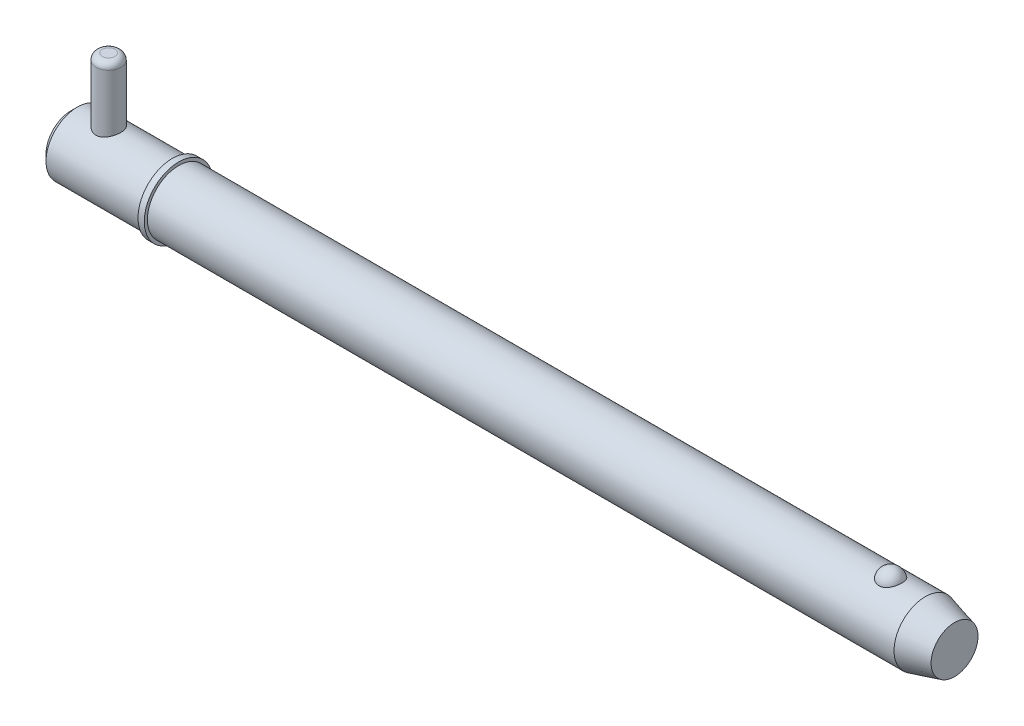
ISO-10303-21;
HEADER;
FILE_DESCRIPTION(('STEP AP214'),'2;1');
FILE_NAME('part.step','',(''),(''),'','','');
FILE_SCHEMA(('AUTOMOTIVE_DESIGN { 1 0 10303 214 1 1 1 1 }'));
ENDSEC;
DATA;
#1=APPLICATION_CONTEXT('core data for automotive mechanical design processes');
#2=APPLICATION_PROTOCOL_DEFINITION('international standard','automotive_design',2000,#1);
#3=PRODUCT_CONTEXT('',#1,'mechanical');
#4=PRODUCT('Part','Part','',(#3));
#5=PRODUCT_RELATED_PRODUCT_CATEGORY('part','',(#4));
#6=PRODUCT_DEFINITION_FORMATION('','',#4);
#7=PRODUCT_DEFINITION_CONTEXT('part definition',#1,'design');
#8=PRODUCT_DEFINITION('design','',#6,#7);
#9=PRODUCT_DEFINITION_SHAPE('','',#8);
#10=(LENGTH_UNIT() NAMED_UNIT(*) SI_UNIT(.MILLI.,.METRE.));
#11=(NAMED_UNIT(*) PLANE_ANGLE_UNIT() SI_UNIT($,.RADIAN.));
#12=(NAMED_UNIT(*) SI_UNIT($,.STERADIAN.) SOLID_ANGLE_UNIT());
#13=UNCERTAINTY_MEASURE_WITH_UNIT(LENGTH_MEASURE(1.E-05),#10,'distance_accuracy_value','');
#14=(GEOMETRIC_REPRESENTATION_CONTEXT(3) GLOBAL_UNCERTAINTY_ASSIGNED_CONTEXT((#13)) GLOBAL_UNIT_ASSIGNED_CONTEXT((#10,
#11,#12)) REPRESENTATION_CONTEXT('',''));
#15=CARTESIAN_POINT('',(0.,0.,0.));
#16=DIRECTION('',(0.,0.,1.));
#17=DIRECTION('',(1.,0.,0.));
#18=AXIS2_PLACEMENT_3D('',#15,#16,#17);
#19=CARTESIAN_POINT('',(9.525,23.81,0.));
#20=DIRECTION('',(0.,-1.,0.));
#21=DIRECTION('',(0.,0.,-1.));
#22=AXIS2_PLACEMENT_3D('',#19,#20,#21);
#23=CYLINDRICAL_SURFACE('',#22,3.175);
#24=CARTESIAN_POINT('',(9.525,-6.3525,0.));
#25=DIRECTION('',(0.,1.,0.));
#26=DIRECTION('',(0.,0.,1.));
#27=AXIS2_PLACEMENT_3D('',#24,#25,#26);
#28=CIRCLE('',#27,3.175);
#29=CARTESIAN_POINT('',(9.525,-6.3525,3.175));
#30=VERTEX_POINT('',#29);
#31=EDGE_CURVE('P0_E25',#30,#30,#28,.T.);
#32=ORIENTED_EDGE('',*,*,#31,.T.);
#33=EDGE_LOOP('',(#32));
#34=FACE_BOUND('',#33,.T.);
#35=CARTESIAN_POINT('',(9.525,22.2225,0.));
#36=DIRECTION('',(0.,1.,0.));
#37=DIRECTION('',(0.,0.,1.));
#38=AXIS2_PLACEMENT_3D('',#35,#36,#37);
#39=CIRCLE('',#38,3.175);
#40=CARTESIAN_POINT('',(9.525,22.2225,3.175));
#41=VERTEX_POINT('',#40);
#42=EDGE_CURVE('P0_E29',#41,#41,#39,.F.);
#43=ORIENTED_EDGE('',*,*,#42,.T.);
#44=EDGE_LOOP('',(#43));
#45=FACE_BOUND('',#44,.T.);
#46=ADVANCED_FACE('P0_F14',(#34,#45),#23,.T.);
#47=CARTESIAN_POINT('',(9.525,23.81,0.));
#48=DIRECTION('',(0.,1.,0.));
#49=DIRECTION('',(0.,0.,1.));
#50=AXIS2_PLACEMENT_3D('',#47,#48,#49);
#51=PLANE('',#50);
#52=CARTESIAN_POINT('',(9.525,23.81,0.));
#53=DIRECTION('',(0.,1.,0.));
#54=DIRECTION('',(0.,0.,1.));
#55=AXIS2_PLACEMENT_3D('',#52,#53,#54);
#56=CIRCLE('',#55,1.5875);
#57=CARTESIAN_POINT('',(9.525,23.81,1.5875));
#58=VERTEX_POINT('',#57);
#59=EDGE_CURVE('P0_E10',#58,#58,#56,.T.);
#60=ORIENTED_EDGE('',*,*,#59,.T.);
#61=EDGE_LOOP('',(#60));
#62=FACE_BOUND('',#61,.T.);
#63=ADVANCED_FACE('P0_F46',(#62),#51,.T.);
#64=CARTESIAN_POINT('',(9.525,-7.94,0.));
#65=DIRECTION('',(0.,1.,0.));
#66=DIRECTION('',(0.,0.,1.));
#67=AXIS2_PLACEMENT_3D('',#64,#65,#66);
#68=PLANE('',#67);
#69=CARTESIAN_POINT('',(9.525,-7.94,0.));
#70=DIRECTION('',(0.,1.,0.));
#71=DIRECTION('',(0.,0.,1.));
#72=AXIS2_PLACEMENT_3D('',#69,#70,#71);
#73=CIRCLE('',#72,1.5875);
#74=CARTESIAN_POINT('',(9.525,-7.94,1.5875));
#75=VERTEX_POINT('',#74);
#76=EDGE_CURVE('P0_E21',#75,#75,#73,.F.);
#77=ORIENTED_EDGE('',*,*,#76,.T.);
#78=EDGE_LOOP('',(#77));
#79=FACE_BOUND('',#78,.T.);
#80=ADVANCED_FACE('P0_F43',(#79),#68,.F.);
#81=CARTESIAN_POINT('',(9.525,-6.3525,0.));
#82=DIRECTION('',(0.,1.,0.));
#83=DIRECTION('',(0.,0.,1.));
#84=AXIS2_PLACEMENT_3D('',#81,#82,#83);
#85=DEGENERATE_TOROIDAL_SURFACE('',#84,1.5875,1.5875,.T.);
#86=ORIENTED_EDGE('',*,*,#76,.F.);
#87=EDGE_LOOP('',(#86));
#88=FACE_BOUND('',#87,.T.);
#89=ORIENTED_EDGE('',*,*,#31,.F.);
#90=EDGE_LOOP('',(#89));
#91=FACE_BOUND('',#90,.T.);
#92=ADVANCED_FACE('P0_F38',(#88,#91),#85,.T.);
#93=CARTESIAN_POINT('',(9.525,22.2225,0.));
#94=DIRECTION('',(0.,1.,0.));
#95=DIRECTION('',(0.,0.,1.));
#96=AXIS2_PLACEMENT_3D('',#93,#94,#95);
#97=DEGENERATE_TOROIDAL_SURFACE('',#96,1.5875,1.5875,.T.);
#98=ORIENTED_EDGE('',*,*,#42,.F.);
#99=EDGE_LOOP('',(#98));
#100=FACE_BOUND('',#99,.T.);
#101=ORIENTED_EDGE('',*,*,#59,.F.);
#102=EDGE_LOOP('',(#101));
#103=FACE_BOUND('',#102,.T.);
#104=ADVANCED_FACE('P0_F16',(#100,#103),#97,.T.);
#105=CLOSED_SHELL('',(#46,#63,#80,#92,#104));
#106=MANIFOLD_SOLID_BREP('P0_B1',#105);
#107=CARTESIAN_POINT('',(0.,0.,0.));
#108=DIRECTION('',(1.,0.,0.));
#109=DIRECTION('',(0.,0.,-1.));
#110=AXIS2_PLACEMENT_3D('',#107,#108,#109);
#111=CYLINDRICAL_SURFACE('',#110,7.94);
#112=CARTESIAN_POINT('',(216.751879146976,0.,0.));
#113=DIRECTION('',(1.,0.,0.));
#114=DIRECTION('',(0.,0.,-1.));
#115=AXIS2_PLACEMENT_3D('',#112,#113,#114);
#116=CIRCLE('',#115,7.94);
#117=CARTESIAN_POINT('',(216.751879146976,0.,-7.94));
#118=VERTEX_POINT('',#117);
#119=EDGE_CURVE('P1_E81',#118,#118,#116,.T.);
#120=ORIENTED_EDGE('',*,*,#119,.F.);
#121=EDGE_LOOP('',(#120));
#122=FACE_BOUND('',#121,.T.);
#123=CARTESIAN_POINT('',(27.31,0.,0.));
#124=DIRECTION('',(1.,0.,0.));
#125=DIRECTION('',(0.,0.,-1.));
#126=AXIS2_PLACEMENT_3D('',#123,#124,#125);
#127=CIRCLE('',#126,7.94);
#128=CARTESIAN_POINT('',(27.31,0.,-7.94));
#129=VERTEX_POINT('',#128);
#130=EDGE_CURVE('P1_E85',#129,#129,#127,.T.);
#131=ORIENTED_EDGE('',*,*,#130,.T.);
#132=EDGE_LOOP('',(#131));
#133=FACE_BOUND('',#132,.T.);
#134=CARTESIAN_POINT('',(207.944907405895,7.37767842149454,2.93486986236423));
#135=CARTESIAN_POINT('',(207.792749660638,7.3776732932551,2.93487505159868));
#136=CARTESIAN_POINT('',(207.640632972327,7.38258419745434,2.92262454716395));
#137=CARTESIAN_POINT('',(207.340928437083,7.40163229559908,2.87404196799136));
#138=CARTESIAN_POINT('',(207.193339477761,7.41576720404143,2.83771585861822));
#139=CARTESIAN_POINT('',(206.907018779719,7.45161576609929,2.74218769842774));
#140=CARTESIAN_POINT('',(206.768274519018,7.47331841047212,2.68301886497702));
#141=CARTESIAN_POINT('',(206.502882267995,7.52194082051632,2.54350967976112));
#142=CARTESIAN_POINT('',(206.376236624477,7.54886159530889,2.46316523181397));
#143=CARTESIAN_POINT('',(206.134534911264,7.60594671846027,2.28090375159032));
#144=CARTESIAN_POINT('',(206.019906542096,7.63618114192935,2.1784421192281));
#145=CARTESIAN_POINT('',(205.808878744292,7.69614046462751,1.95608495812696));
#146=CARTESIAN_POINT('',(205.712482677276,7.72586526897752,1.83618622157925));
#147=CARTESIAN_POINT('',(205.535938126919,7.78314821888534,1.57628086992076));
#148=CARTESIAN_POINT('',(205.456707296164,7.81055035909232,1.43561546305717));
#149=CARTESIAN_POINT('',(205.321797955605,7.85879631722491,1.14236334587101));
#150=CARTESIAN_POINT('',(205.266121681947,7.87963951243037,0.989775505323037));
#151=CARTESIAN_POINT('',(205.17881215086,7.91289645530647,0.674619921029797));
#152=CARTESIAN_POINT('',(205.14753090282,7.92518652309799,0.511941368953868));
#153=CARTESIAN_POINT('',(205.110975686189,7.93958930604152,0.183247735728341));
#154=CARTESIAN_POINT('',(205.105701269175,7.94170219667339,0.0172327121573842));
#155=CARTESIAN_POINT('',(205.121231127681,7.93554931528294,-0.312672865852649));
#156=CARTESIAN_POINT('',(205.141925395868,7.92732732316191,-0.476569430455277));
#157=CARTESIAN_POINT('',(205.20878655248,7.90141534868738,-0.79830524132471));
#158=CARTESIAN_POINT('',(205.254953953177,7.88372517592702,-0.956144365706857));
#159=CARTESIAN_POINT('',(205.371898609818,7.84066230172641,-1.26152073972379));
#160=CARTESIAN_POINT('',(205.442704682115,7.81528060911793,-1.40904568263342));
#161=CARTESIAN_POINT('',(205.607478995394,7.75948672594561,-1.68950598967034));
#162=CARTESIAN_POINT('',(205.701448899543,7.72907417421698,-1.82244030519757));
#163=CARTESIAN_POINT('',(205.910839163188,7.66640424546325,-2.07032792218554));
#164=CARTESIAN_POINT('',(206.026315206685,7.63414223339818,-2.18523308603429));
#165=CARTESIAN_POINT('',(206.2759006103,7.57149681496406,-2.39329737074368));
#166=CARTESIAN_POINT('',(206.410008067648,7.54111321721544,-2.48645870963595));
#167=CARTESIAN_POINT('',(206.690111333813,7.48650742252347,-2.64628132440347));
#168=CARTESIAN_POINT('',(206.835760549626,7.46215900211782,-2.71350554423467));
#169=CARTESIAN_POINT('',(207.137425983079,7.42171253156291,-2.82226614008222));
#170=CARTESIAN_POINT('',(207.293438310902,7.40561140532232,-2.86381209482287));
#171=CARTESIAN_POINT('',(207.602970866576,7.3842679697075,-2.9183907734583));
#172=CARTESIAN_POINT('',(207.756222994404,7.37852109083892,-2.93275024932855));
#173=CARTESIAN_POINT('',(208.063070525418,7.37700973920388,-2.93655208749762));
#174=CARTESIAN_POINT('',(208.216665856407,7.38124333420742,-2.92599927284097));
#175=CARTESIAN_POINT('',(208.514990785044,7.39890635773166,-2.88102897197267));
#176=CARTESIAN_POINT('',(208.659848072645,7.41205491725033,-2.84733999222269));
#177=CARTESIAN_POINT('',(208.94164329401,7.445801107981,-2.75788206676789));
#178=CARTESIAN_POINT('',(209.078580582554,7.46639934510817,-2.70211132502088));
#179=CARTESIAN_POINT('',(209.344061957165,7.51339098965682,-2.56858908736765));
#180=CARTESIAN_POINT('',(209.472354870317,7.53990200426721,-2.4903806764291));
#181=CARTESIAN_POINT('',(209.714244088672,7.59569503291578,-2.31462737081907));
#182=CARTESIAN_POINT('',(209.827837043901,7.6249776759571,-2.21707808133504));
#183=CARTESIAN_POINT('',(210.04322156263,7.68489473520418,-1.99982049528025));
#184=CARTESIAN_POINT('',(210.144148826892,7.71552419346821,-1.87925337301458));
#185=CARTESIAN_POINT('',(210.325186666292,7.77353016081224,-1.6226882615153));
#186=CARTESIAN_POINT('',(210.405293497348,7.80090608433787,-1.48668750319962));
#187=CARTESIAN_POINT('',(210.545361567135,7.85047992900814,-1.1981841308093));
#188=CARTESIAN_POINT('',(210.604587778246,7.87248183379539,-1.04529016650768));
#189=CARTESIAN_POINT('',(210.697982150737,7.90785114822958,-0.731080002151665));
#190=CARTESIAN_POINT('',(210.732149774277,7.92121837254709,-0.569763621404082));
#191=CARTESIAN_POINT('',(210.774795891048,7.93797834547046,-0.242812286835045));
#192=CARTESIAN_POINT('',(210.783204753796,7.94134405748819,-0.0771668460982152));
#193=CARTESIAN_POINT('',(210.773962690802,7.93767937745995,0.253276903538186));
#194=CARTESIAN_POINT('',(210.756312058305,7.93064910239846,0.418075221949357));
#195=CARTESIAN_POINT('',(210.695424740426,7.90695571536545,0.741525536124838));
#196=CARTESIAN_POINT('',(210.652281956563,7.8903279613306,0.900197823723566));
#197=CARTESIAN_POINT('',(210.54135358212,7.84916386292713,1.20759654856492));
#198=CARTESIAN_POINT('',(210.47356656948,7.82462706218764,1.35632241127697));
#199=CARTESIAN_POINT('',(210.314371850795,7.77006699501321,1.64032869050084));
#200=CARTESIAN_POINT('',(210.222861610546,7.74002008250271,1.7755471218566));
#201=CARTESIAN_POINT('',(210.018296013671,7.67774175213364,2.0280064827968));
#202=CARTESIAN_POINT('',(209.905241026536,7.64551037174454,2.14524772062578));
#203=CARTESIAN_POINT('',(209.660831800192,7.58265895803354,2.35778002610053));
#204=CARTESIAN_POINT('',(209.529583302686,7.5520309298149,2.45319004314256));
#205=CARTESIAN_POINT('',(209.251601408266,7.49579792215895,2.61999897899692));
#206=CARTESIAN_POINT('',(209.104867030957,7.4701932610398,2.69139637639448));
#207=CARTESIAN_POINT('',(208.792947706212,7.42622216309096,2.8105324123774));
#208=CARTESIAN_POINT('',(208.627220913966,7.40825002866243,2.85700910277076));
#209=CARTESIAN_POINT('',(208.289279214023,7.38398348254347,2.9191685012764));
#210=CARTESIAN_POINT('',(208.11706702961,7.3776842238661,2.93486399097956));
#211=CARTESIAN_POINT('',(207.944907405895,7.37767842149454,2.93486986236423));
#212=B_SPLINE_CURVE_WITH_KNOTS('',3,(#134,#135,#136,#137,#138,#139,#140,#141,#142,#143,#144,
#145,#146,#147,#148,#149,#150,#151,#152,#153,#154,#155,#156,#157,#158,#159,#160,#161,#162,#163,
#164,#165,#166,#167,#168,#169,#170,#171,#172,#173,#174,#175,#176,#177,#178,#179,#180,#181,#182,
#183,#184,#185,#186,#187,#188,#189,#190,#191,#192,#193,#194,#195,#196,#197,#198,#199,#200,#201,
#202,#203,#204,#205,#206,#207,#208,#209,#210,#211),.UNSPECIFIED.,.T.,.F.,(4,2,2,2,2,2,2,2,2,2,2,
2,2,2,2,2,2,2,2,2,2,2,2,2,2,2,2,2,2,2,2,2,2,2,2,2,2,2,4),(0.,0.455841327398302,
0.911569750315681,1.36663794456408,1.82179423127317,2.2897898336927,2.75787163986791,
3.24685368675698,3.73588214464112,4.23184282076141,4.72779494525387,5.22165321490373,
5.71552141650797,6.20996917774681,6.7044524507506,7.20023431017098,7.69596557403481,
8.18023418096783,8.66432203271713,9.12410697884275,9.58380291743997,10.0296503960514,
10.4755341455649,10.9312349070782,11.3870393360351,11.8654416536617,12.3439299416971,
12.8378875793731,13.3318558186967,13.8271581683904,14.3224549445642,14.8159385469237,
15.3094506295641,15.8051323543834,16.3008055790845,16.7937101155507,17.2866458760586,
17.8026240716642,18.3183879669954),.UNSPECIFIED.);
#213=CARTESIAN_POINT('',(207.944907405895,7.37767842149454,2.93486986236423));
#214=VERTEX_POINT('',#213);
#215=EDGE_CURVE('P1_E35',#214,#214,#212,.T.);
#216=ORIENTED_EDGE('',*,*,#215,.T.);
#217=EDGE_LOOP('',(#216));
#218=FACE_BOUND('',#217,.T.);
#219=ADVANCED_FACE('P1_F13',(#122,#133,#218),#111,.T.);
#220=CARTESIAN_POINT('',(0.,0.,0.));
#221=DIRECTION('',(-1.,0.,0.));
#222=DIRECTION('',(0.,0.,1.));
#223=AXIS2_PLACEMENT_3D('',#220,#221,#222);
#224=PLANE('',#223);
#225=CARTESIAN_POINT('',(0.,0.,0.));
#226=DIRECTION('',(1.,0.,0.));
#227=DIRECTION('',(0.,0.,-1.));
#228=AXIS2_PLACEMENT_3D('',#225,#226,#227);
#229=CIRCLE('',#228,6.352);
#230=CARTESIAN_POINT('',(0.,0.,-6.352));
#231=VERTEX_POINT('',#230);
#232=EDGE_CURVE('P1_E9',#231,#231,#229,.T.);
#233=ORIENTED_EDGE('',*,*,#232,.F.);
#234=EDGE_LOOP('',(#233));
#235=FACE_BOUND('',#234,.T.);
#236=ADVANCED_FACE('P1_F15',(#235),#224,.T.);
#237=CARTESIAN_POINT('',(1.58799999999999,0.,0.));
#238=DIRECTION('',(1.,0.,0.));
#239=DIRECTION('',(0.,0.,-1.));
#240=AXIS2_PLACEMENT_3D('',#237,#238,#239);
#241=CONICAL_SURFACE('',#240,7.94,0.78539816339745);
#242=ORIENTED_EDGE('',*,*,#232,.T.);
#243=EDGE_LOOP('',(#242));
#244=FACE_BOUND('',#243,.T.);
#245=CARTESIAN_POINT('',(1.58799999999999,0.,0.));
#246=DIRECTION('',(1.,0.,0.));
#247=DIRECTION('',(0.,0.,-1.));
#248=AXIS2_PLACEMENT_3D('',#245,#246,#247);
#249=CIRCLE('',#248,7.94);
#250=CARTESIAN_POINT('',(1.58799999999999,0.,-7.94));
#251=VERTEX_POINT('',#250);
#252=EDGE_CURVE('P1_E26',#251,#251,#249,.T.);
#253=ORIENTED_EDGE('',*,*,#252,.F.);
#254=EDGE_LOOP('',(#253));
#255=FACE_BOUND('',#254,.T.);
#256=ADVANCED_FACE('P1_F77',(#244,#255),#241,.T.);
#257=CARTESIAN_POINT('',(0.,0.,0.));
#258=DIRECTION('',(1.,0.,0.));
#259=DIRECTION('',(0.,0.,-1.));
#260=AXIS2_PLACEMENT_3D('',#257,#258,#259);
#261=CYLINDRICAL_SURFACE('',#260,7.94);
#262=CARTESIAN_POINT('',(9.525,-7.27756655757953,3.175));
#263=CARTESIAN_POINT('',(9.43992346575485,-7.27756715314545,3.17499935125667));
#264=CARTESIAN_POINT('',(9.35481882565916,-7.27906496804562,3.1715736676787));
#265=CARTESIAN_POINT('',(9.18524505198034,-7.28499816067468,3.15791803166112));
#266=CARTESIAN_POINT('',(9.100776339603,-7.28943533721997,3.14768391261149));
#267=CARTESIAN_POINT('',(8.84895715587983,-7.30698881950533,3.10684226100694));
#268=CARTESIAN_POINT('',(8.6834173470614,-7.32434654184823,3.06609574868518));
#269=CARTESIAN_POINT('',(8.36278910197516,-7.36806950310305,2.95945910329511));
#270=CARTESIAN_POINT('',(8.20766386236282,-7.39440078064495,2.89366366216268));
#271=CARTESIAN_POINT('',(7.91065319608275,-7.45304562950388,2.73907413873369));
#272=CARTESIAN_POINT('',(7.76876488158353,-7.48535789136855,2.65028508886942));
#273=CARTESIAN_POINT('',(7.49411086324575,-7.55439482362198,2.44679888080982));
#274=CARTESIAN_POINT('',(7.36219910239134,-7.59126138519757,2.33099745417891));
#275=CARTESIAN_POINT('',(7.11904234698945,-7.66408045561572,2.07909838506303));
#276=CARTESIAN_POINT('',(7.00780457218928,-7.70003264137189,1.94299368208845));
#277=CARTESIAN_POINT('',(6.80492173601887,-7.76867514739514,1.64775981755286));
#278=CARTESIAN_POINT('',(6.71422139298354,-7.80118112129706,1.48793473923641));
#279=CARTESIAN_POINT('',(6.56135788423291,-7.85754918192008,1.15376269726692));
#280=CARTESIAN_POINT('',(6.49918311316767,-7.88141478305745,0.979421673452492));
#281=CARTESIAN_POINT('',(6.40818142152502,-7.91680873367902,0.630115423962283));
#282=CARTESIAN_POINT('',(6.3778864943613,-7.9288781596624,0.455588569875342));
#283=CARTESIAN_POINT('',(6.34677743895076,-7.94127547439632,0.103539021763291));
#284=CARTESIAN_POINT('',(6.34595232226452,-7.94160773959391,-0.0739825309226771));
#285=CARTESIAN_POINT('',(6.37300128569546,-7.93082261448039,-0.416371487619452));
#286=CARTESIAN_POINT('',(6.39926693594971,-7.92034690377,-0.581389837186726));
#287=CARTESIAN_POINT('',(6.47701615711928,-7.88998770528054,-0.904449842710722));
#288=CARTESIAN_POINT('',(6.52850157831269,-7.87010352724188,-1.06249098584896));
#289=CARTESIAN_POINT('',(6.65586120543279,-7.82249343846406,-1.36995769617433));
#290=CARTESIAN_POINT('',(6.73209124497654,-7.79465387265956,-1.51921754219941));
#291=CARTESIAN_POINT('',(6.90644286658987,-7.73389606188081,-1.80321183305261));
#292=CARTESIAN_POINT('',(7.00457194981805,-7.70097607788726,-1.93794127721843));
#293=CARTESIAN_POINT('',(7.22744086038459,-7.63084889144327,-2.19843606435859));
#294=CARTESIAN_POINT('',(7.35350432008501,-7.59350211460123,-2.3230330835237));
#295=CARTESIAN_POINT('',(7.62488266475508,-7.52039654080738,-2.54979642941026));
#296=CARTESIAN_POINT('',(7.77020381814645,-7.48463826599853,-2.65195542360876));
#297=CARTESIAN_POINT('',(8.08119298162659,-7.41780943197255,-2.83361305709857));
#298=CARTESIAN_POINT('',(8.24731937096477,-7.38689959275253,-2.91239105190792));
#299=CARTESIAN_POINT('',(8.59204539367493,-7.33515216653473,-3.04038913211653));
#300=CARTESIAN_POINT('',(8.77063684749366,-7.31430804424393,-3.08962840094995));
#301=CARTESIAN_POINT('',(9.12356982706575,-7.28663831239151,-3.15431018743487));
#302=CARTESIAN_POINT('',(9.29750494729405,-7.2790344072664,-3.17163284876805));
#303=CARTESIAN_POINT('',(9.64592502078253,-7.27648884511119,-3.17747282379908));
#304=CARTESIAN_POINT('',(9.82040979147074,-7.28154335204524,-3.16599886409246));
#305=CARTESIAN_POINT('',(10.1545374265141,-7.30294638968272,-3.11628310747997));
#306=CARTESIAN_POINT('',(10.3144598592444,-7.31863587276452,-3.0796016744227));
#307=CARTESIAN_POINT('',(10.625774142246,-7.35872371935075,-2.98253618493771));
#308=CARTESIAN_POINT('',(10.7771640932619,-7.38312401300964,-2.92214687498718));
#309=CARTESIAN_POINT('',(11.0739599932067,-7.4390944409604,-2.77664664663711));
#310=CARTESIAN_POINT('',(11.2188745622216,-7.47091513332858,-2.69063278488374));
#311=CARTESIAN_POINT('',(11.4928722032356,-7.53775867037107,-2.49724834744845));
#312=CARTESIAN_POINT('',(11.6219487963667,-7.57278281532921,-2.38986907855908));
#313=CARTESIAN_POINT('',(11.8705091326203,-7.64520845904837,-2.1474449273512));
#314=CARTESIAN_POINT('',(11.9885816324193,-7.68259462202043,-2.01094304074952));
#315=CARTESIAN_POINT('',(12.2003631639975,-7.75309951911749,-1.71917041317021));
#316=CARTESIAN_POINT('',(12.2940712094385,-7.78621808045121,-1.56389891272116));
#317=CARTESIAN_POINT('',(12.4541161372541,-7.84456050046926,-1.23845027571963));
#318=CARTESIAN_POINT('',(12.5204600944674,-7.86978639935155,-1.06827700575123));
#319=CARTESIAN_POINT('',(12.6231407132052,-7.90943635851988,-0.717928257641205));
#320=CARTESIAN_POINT('',(12.6594936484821,-7.92386627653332,-0.537758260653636));
#321=CARTESIAN_POINT('',(12.6992281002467,-7.93967263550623,-0.185201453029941));
#322=CARTESIAN_POINT('',(12.7046050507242,-7.94183891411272,-0.0130732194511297));
#323=CARTESIAN_POINT('',(12.6875036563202,-7.9350072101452,0.329549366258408));
#324=CARTESIAN_POINT('',(12.6650295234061,-7.92601091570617,0.500043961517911));
#325=CARTESIAN_POINT('',(12.5942896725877,-7.89825976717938,0.829196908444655));
#326=CARTESIAN_POINT('',(12.5468364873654,-7.87981280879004,0.988057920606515));
#327=CARTESIAN_POINT('',(12.4283390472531,-7.83513565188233,1.29553461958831));
#328=CARTESIAN_POINT('',(12.3572904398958,-7.8089040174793,1.44414841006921));
#329=CARTESIAN_POINT('',(12.1900822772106,-7.7497911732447,1.73412879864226));
#330=CARTESIAN_POINT('',(12.0929519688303,-7.71666737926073,1.87488510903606));
#331=CARTESIAN_POINT('',(11.8777894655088,-7.64775894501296,2.13869231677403));
#332=CARTESIAN_POINT('',(11.7597486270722,-7.61197320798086,2.26173585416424));
#333=CARTESIAN_POINT('',(11.4974896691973,-7.53902341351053,2.49449755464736));
#334=CARTESIAN_POINT('',(11.3521039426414,-7.50191102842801,2.60292060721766));
#335=CARTESIAN_POINT('',(11.0440201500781,-7.43289551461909,2.79392602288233));
#336=CARTESIAN_POINT('',(10.8813200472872,-7.40099299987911,2.87650534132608));
#337=CARTESIAN_POINT('',(10.558064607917,-7.3489506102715,3.00682739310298));
#338=CARTESIAN_POINT('',(10.398627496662,-7.32801197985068,3.05703164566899));
#339=CARTESIAN_POINT('',(10.0731242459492,-7.29639491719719,3.13175843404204));
#340=CARTESIAN_POINT('',(9.90707793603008,-7.28568789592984,3.15635254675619));
#341=CARTESIAN_POINT('',(9.70441566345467,-7.27968826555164,3.17013149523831));
#342=CARTESIAN_POINT('',(9.66856669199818,-7.27889378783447,3.17195593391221));
#343=CARTESIAN_POINT('',(9.59681348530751,-7.27783278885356,3.17439036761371));
#344=CARTESIAN_POINT('',(9.56090924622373,-7.27756630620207,3.17500027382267));
#345=CARTESIAN_POINT('',(9.525,-7.27756655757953,3.175));
#346=B_SPLINE_CURVE_WITH_KNOTS('',3,(#262,#263,#264,#265,#266,#267,#268,#269,#270,#271,#272,
#273,#274,#275,#276,#277,#278,#279,#280,#281,#282,#283,#284,#285,#286,#287,#288,#289,#290,#291,
#292,#293,#294,#295,#296,#297,#298,#299,#300,#301,#302,#303,#304,#305,#306,#307,#308,#309,#310,
#311,#312,#313,#314,#315,#316,#317,#318,#319,#320,#321,#322,#323,#324,#325,#326,#327,#328,#329,
#330,#331,#332,#333,#334,#335,#336,#337,#338,#339,#340,#341,#342,#343,#344,#345),.UNSPECIFIED.,
.T.,.F.,(4,2,2,2,2,2,2,2,2,2,2,2,2,2,2,2,2,2,2,2,2,2,2,2,2,2,2,2,2,2,2,2,2,2,2,2,2,2,2,2,2,4),
(0.,0.255187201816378,0.510530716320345,1.0218798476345,1.53131482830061,2.04063840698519,
2.57635929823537,3.11226692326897,3.66929090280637,4.22608806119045,4.75594400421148,
5.28560237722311,5.78552836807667,6.28549104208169,6.79298787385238,7.30065880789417,
7.8416422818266,8.38280228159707,8.93923025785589,9.49529647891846,10.0174074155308,
10.5393601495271,11.0316114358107,11.5239718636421,12.0362920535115,12.5488211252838,
13.0991799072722,13.6495609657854,14.1997996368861,14.7497395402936,15.2638187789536,
15.7778202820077,16.2760504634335,16.7743726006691,17.294711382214,17.8152657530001,
18.3680208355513,18.9208410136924,19.4240423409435,19.9258334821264,20.0335354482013,
20.1412452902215),.UNSPECIFIED.);
#347=CARTESIAN_POINT('',(9.525,-7.27756655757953,3.175));
#348=VERTEX_POINT('',#347);
#349=EDGE_CURVE('P1_E17',#348,#348,#346,.T.);
#350=ORIENTED_EDGE('',*,*,#349,.F.);
#351=EDGE_LOOP('',(#350));
#352=FACE_BOUND('',#351,.T.);
#353=CARTESIAN_POINT('',(9.525,7.27756655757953,3.175));
#354=CARTESIAN_POINT('',(9.61007653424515,7.27756715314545,3.17499935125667));
#355=CARTESIAN_POINT('',(9.69518117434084,7.27906496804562,3.1715736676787));
#356=CARTESIAN_POINT('',(9.86475494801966,7.28499816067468,3.15791803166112));
#357=CARTESIAN_POINT('',(9.949223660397,7.28943533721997,3.14768391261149));
#358=CARTESIAN_POINT('',(10.2010428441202,7.30698881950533,3.10684226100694));
#359=CARTESIAN_POINT('',(10.3665826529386,7.32434654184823,3.06609574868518));
#360=CARTESIAN_POINT('',(10.6872108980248,7.36806950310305,2.95945910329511));
#361=CARTESIAN_POINT('',(10.8423361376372,7.39440078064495,2.89366366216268));
#362=CARTESIAN_POINT('',(11.1393468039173,7.45304562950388,2.73907413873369));
#363=CARTESIAN_POINT('',(11.2812351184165,7.48535789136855,2.65028508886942));
#364=CARTESIAN_POINT('',(11.5558891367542,7.55439482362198,2.44679888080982));
#365=CARTESIAN_POINT('',(11.6878008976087,7.59126138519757,2.33099745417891));
#366=CARTESIAN_POINT('',(11.9309576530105,7.66408045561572,2.07909838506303));
#367=CARTESIAN_POINT('',(12.0421954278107,7.70003264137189,1.94299368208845));
#368=CARTESIAN_POINT('',(12.2450782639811,7.76867514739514,1.64775981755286));
#369=CARTESIAN_POINT('',(12.3357786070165,7.80118112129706,1.48793473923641));
#370=CARTESIAN_POINT('',(12.4886421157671,7.85754918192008,1.15376269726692));
#371=CARTESIAN_POINT('',(12.5508168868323,7.88141478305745,0.979421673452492));
#372=CARTESIAN_POINT('',(12.641818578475,7.91680873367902,0.630115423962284));
#373=CARTESIAN_POINT('',(12.6721135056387,7.9288781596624,0.455588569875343));
#374=CARTESIAN_POINT('',(12.7032225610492,7.94127547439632,0.103539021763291));
#375=CARTESIAN_POINT('',(12.7040476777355,7.94160773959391,-0.0739825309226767));
#376=CARTESIAN_POINT('',(12.6769987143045,7.93082261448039,-0.416371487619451));
#377=CARTESIAN_POINT('',(12.6507330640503,7.92034690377,-0.581389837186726));
#378=CARTESIAN_POINT('',(12.5729838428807,7.88998770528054,-0.904449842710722));
#379=CARTESIAN_POINT('',(12.5214984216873,7.87010352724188,-1.06249098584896));
#380=CARTESIAN_POINT('',(12.3941387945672,7.82249343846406,-1.36995769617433));
#381=CARTESIAN_POINT('',(12.3179087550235,7.79465387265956,-1.51921754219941));
#382=CARTESIAN_POINT('',(12.1435571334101,7.73389606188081,-1.80321183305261));
#383=CARTESIAN_POINT('',(12.0454280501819,7.70097607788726,-1.93794127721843));
#384=CARTESIAN_POINT('',(11.8225591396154,7.63084889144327,-2.19843606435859));
#385=CARTESIAN_POINT('',(11.696495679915,7.59350211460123,-2.3230330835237));
#386=CARTESIAN_POINT('',(11.4251173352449,7.52039654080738,-2.54979642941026));
#387=CARTESIAN_POINT('',(11.2797961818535,7.48463826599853,-2.65195542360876));
#388=CARTESIAN_POINT('',(10.9688070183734,7.41780943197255,-2.83361305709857));
#389=CARTESIAN_POINT('',(10.8026806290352,7.38689959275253,-2.91239105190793));
#390=CARTESIAN_POINT('',(10.4579546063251,7.33515216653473,-3.04038913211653));
#391=CARTESIAN_POINT('',(10.2793631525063,7.31430804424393,-3.08962840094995));
#392=CARTESIAN_POINT('',(9.92643017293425,7.28663831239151,-3.15431018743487));
#393=CARTESIAN_POINT('',(9.75249505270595,7.2790344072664,-3.17163284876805));
#394=CARTESIAN_POINT('',(9.40407497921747,7.2764888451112,-3.17747282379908));
#395=CARTESIAN_POINT('',(9.22959020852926,7.28154335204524,-3.16599886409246));
#396=CARTESIAN_POINT('',(8.89546257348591,7.30294638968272,-3.11628310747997));
#397=CARTESIAN_POINT('',(8.73554014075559,7.31863587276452,-3.0796016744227));
#398=CARTESIAN_POINT('',(8.42422585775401,7.35872371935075,-2.98253618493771));
#399=CARTESIAN_POINT('',(8.27283590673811,7.38312401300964,-2.92214687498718));
#400=CARTESIAN_POINT('',(7.97604000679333,7.4390944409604,-2.77664664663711));
#401=CARTESIAN_POINT('',(7.83112543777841,7.47091513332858,-2.69063278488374));
#402=CARTESIAN_POINT('',(7.55712779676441,7.53775867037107,-2.49724834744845));
#403=CARTESIAN_POINT('',(7.42805120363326,7.57278281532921,-2.38986907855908));
#404=CARTESIAN_POINT('',(7.17949086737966,7.64520845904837,-2.1474449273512));
#405=CARTESIAN_POINT('',(7.06141836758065,7.68259462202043,-2.01094304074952));
#406=CARTESIAN_POINT('',(6.8496368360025,7.75309951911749,-1.71917041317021));
#407=CARTESIAN_POINT('',(6.75592879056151,7.78621808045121,-1.56389891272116));
#408=CARTESIAN_POINT('',(6.59588386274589,7.84456050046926,-1.23845027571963));
#409=CARTESIAN_POINT('',(6.52953990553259,7.86978639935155,-1.06827700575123));
#410=CARTESIAN_POINT('',(6.42685928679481,7.90943635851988,-0.717928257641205));
#411=CARTESIAN_POINT('',(6.39050635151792,7.92386627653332,-0.537758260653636));
#412=CARTESIAN_POINT('',(6.35077189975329,7.93967263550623,-0.18520145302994));
#413=CARTESIAN_POINT('',(6.34539494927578,7.94183891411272,-0.0130732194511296));
#414=CARTESIAN_POINT('',(6.36249634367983,7.9350072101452,0.329549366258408));
#415=CARTESIAN_POINT('',(6.38497047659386,7.92601091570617,0.500043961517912));
#416=CARTESIAN_POINT('',(6.45571032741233,7.89825976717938,0.829196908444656));
#417=CARTESIAN_POINT('',(6.50316351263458,7.87981280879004,0.988057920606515));
#418=CARTESIAN_POINT('',(6.62166095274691,7.83513565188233,1.29553461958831));
#419=CARTESIAN_POINT('',(6.69270956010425,7.8089040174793,1.44414841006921));
#420=CARTESIAN_POINT('',(6.85991772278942,7.7497911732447,1.73412879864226));
#421=CARTESIAN_POINT('',(6.95704803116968,7.71666737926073,1.87488510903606));
#422=CARTESIAN_POINT('',(7.17221053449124,7.64775894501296,2.13869231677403));
#423=CARTESIAN_POINT('',(7.29025137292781,7.61197320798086,2.26173585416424));
#424=CARTESIAN_POINT('',(7.55251033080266,7.53902341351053,2.49449755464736));
#425=CARTESIAN_POINT('',(7.69789605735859,7.50191102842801,2.60292060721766));
#426=CARTESIAN_POINT('',(8.00597984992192,7.43289551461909,2.79392602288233));
#427=CARTESIAN_POINT('',(8.16867995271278,7.40099299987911,2.87650534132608));
#428=CARTESIAN_POINT('',(8.49193539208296,7.3489506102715,3.00682739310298));
#429=CARTESIAN_POINT('',(8.65137250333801,7.32801197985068,3.05703164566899));
#430=CARTESIAN_POINT('',(8.97687575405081,7.29639491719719,3.13175843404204));
#431=CARTESIAN_POINT('',(9.14292206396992,7.28568789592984,3.15635254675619));
#432=CARTESIAN_POINT('',(9.34558433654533,7.27968826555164,3.17013149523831));
#433=CARTESIAN_POINT('',(9.38143330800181,7.27889378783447,3.17195593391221));
#434=CARTESIAN_POINT('',(9.45318651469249,7.27783278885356,3.17439036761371));
#435=CARTESIAN_POINT('',(9.48909075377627,7.27756630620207,3.17500027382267));
#436=CARTESIAN_POINT('',(9.525,7.27756655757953,3.175));
#437=B_SPLINE_CURVE_WITH_KNOTS('',3,(#353,#354,#355,#356,#357,#358,#359,#360,#361,#362,#363,
#364,#365,#366,#367,#368,#369,#370,#371,#372,#373,#374,#375,#376,#377,#378,#379,#380,#381,#382,
#383,#384,#385,#386,#387,#388,#389,#390,#391,#392,#393,#394,#395,#396,#397,#398,#399,#400,#401,
#402,#403,#404,#405,#406,#407,#408,#409,#410,#411,#412,#413,#414,#415,#416,#417,#418,#419,#420,
#421,#422,#423,#424,#425,#426,#427,#428,#429,#430,#431,#432,#433,#434,#435,#436),.UNSPECIFIED.,
.T.,.F.,(4,2,2,2,2,2,2,2,2,2,2,2,2,2,2,2,2,2,2,2,2,2,2,2,2,2,2,2,2,2,2,2,2,2,2,2,2,2,2,2,2,4),
(0.,0.255187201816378,0.510530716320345,1.0218798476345,1.53131482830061,2.04063840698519,
2.57635929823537,3.11226692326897,3.66929090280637,4.22608806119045,4.75594400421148,
5.2856023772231,5.78552836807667,6.28549104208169,6.79298787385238,7.30065880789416,
7.8416422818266,8.38280228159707,8.9392302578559,9.49529647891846,10.0174074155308,
10.5393601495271,11.0316114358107,11.5239718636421,12.0362920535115,12.5488211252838,
13.0991799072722,13.6495609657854,14.1997996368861,14.7497395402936,15.2638187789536,
15.7778202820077,16.2760504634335,16.7743726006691,17.294711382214,17.8152657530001,
18.3680208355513,18.9208410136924,19.4240423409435,19.9258334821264,20.0335354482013,
20.1412452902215),.UNSPECIFIED.);
#438=CARTESIAN_POINT('',(9.525,7.27756655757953,3.175));
#439=VERTEX_POINT('',#438);
#440=EDGE_CURVE('P1_E43',#439,#439,#437,.T.);
#441=ORIENTED_EDGE('',*,*,#440,.F.);
#442=EDGE_LOOP('',(#441));
#443=FACE_BOUND('',#442,.T.);
#444=ORIENTED_EDGE('',*,*,#252,.T.);
#445=EDGE_LOOP('',(#444));
#446=FACE_BOUND('',#445,.T.);
#447=CARTESIAN_POINT('',(25.722,0.,0.));
#448=DIRECTION('',(1.,0.,0.));
#449=DIRECTION('',(0.,0.,-1.));
#450=AXIS2_PLACEMENT_3D('',#447,#448,#449);
#451=CIRCLE('',#450,7.94);
#452=CARTESIAN_POINT('',(25.722,0.,-7.94));
#453=VERTEX_POINT('',#452);
#454=EDGE_CURVE('P1_E31',#453,#453,#451,.T.);
#455=ORIENTED_EDGE('',*,*,#454,.F.);
#456=EDGE_LOOP('',(#455));
#457=FACE_BOUND('',#456,.T.);
#458=ADVANCED_FACE('P1_F103',(#352,#443,#446,#457),#261,.T.);
#459=CARTESIAN_POINT('',(25.722,7.94,0.));
#460=DIRECTION('',(-1.,0.,0.));
#461=DIRECTION('',(0.,0.,1.));
#462=AXIS2_PLACEMENT_3D('',#459,#460,#461);
#463=PLANE('',#462);
#464=ORIENTED_EDGE('',*,*,#454,.T.);
#465=EDGE_LOOP('',(#464));
#466=FACE_BOUND('',#465,.T.);
#467=CARTESIAN_POINT('',(25.722,0.,0.));
#468=DIRECTION('',(1.,0.,0.));
#469=DIRECTION('',(0.,0.,-1.));
#470=AXIS2_PLACEMENT_3D('',#467,#468,#469);
#471=CIRCLE('',#470,8.734);
#472=CARTESIAN_POINT('',(25.722,0.,-8.734));
#473=VERTEX_POINT('',#472);
#474=EDGE_CURVE('P1_E91',#473,#473,#471,.T.);
#475=ORIENTED_EDGE('',*,*,#474,.F.);
#476=EDGE_LOOP('',(#475));
#477=FACE_BOUND('',#476,.T.);
#478=ADVANCED_FACE('P1_F100',(#466,#477),#463,.T.);
#479=CARTESIAN_POINT('',(0.,0.,0.));
#480=DIRECTION('',(1.,0.,0.));
#481=DIRECTION('',(0.,0.,-1.));
#482=AXIS2_PLACEMENT_3D('',#479,#480,#481);
#483=CYLINDRICAL_SURFACE('',#482,8.734);
#484=ORIENTED_EDGE('',*,*,#474,.T.);
#485=EDGE_LOOP('',(#484));
#486=FACE_BOUND('',#485,.T.);
#487=CARTESIAN_POINT('',(27.31,0.,0.));
#488=DIRECTION('',(1.,0.,0.));
#489=DIRECTION('',(0.,0.,-1.));
#490=AXIS2_PLACEMENT_3D('',#487,#488,#489);
#491=CIRCLE('',#490,8.734);
#492=CARTESIAN_POINT('',(27.31,0.,-8.734));
#493=VERTEX_POINT('',#492);
#494=EDGE_CURVE('P1_E88',#493,#493,#491,.T.);
#495=ORIENTED_EDGE('',*,*,#494,.F.);
#496=EDGE_LOOP('',(#495));
#497=FACE_BOUND('',#496,.T.);
#498=ADVANCED_FACE('P1_F68',(#486,#497),#483,.T.);
#499=CARTESIAN_POINT('',(27.31,8.734,0.));
#500=DIRECTION('',(1.,0.,0.));
#501=DIRECTION('',(0.,0.,-1.));
#502=AXIS2_PLACEMENT_3D('',#499,#500,#501);
#503=PLANE('',#502);
#504=ORIENTED_EDGE('',*,*,#494,.T.);
#505=EDGE_LOOP('',(#504));
#506=FACE_BOUND('',#505,.T.);
#507=ORIENTED_EDGE('',*,*,#130,.F.);
#508=EDGE_LOOP('',(#507));
#509=FACE_BOUND('',#508,.T.);
#510=ADVANCED_FACE('P1_F62',(#506,#509),#503,.T.);
#511=CARTESIAN_POINT('',(224.16,0.,0.));
#512=DIRECTION('',(-1.,0.,0.));
#513=DIRECTION('',(0.,0.,1.));
#514=AXIS2_PLACEMENT_3D('',#511,#512,#513);
#515=CONICAL_SURFACE('',#514,5.95500000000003,0.26179938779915);
#516=ORIENTED_EDGE('',*,*,#119,.T.);
#517=EDGE_LOOP('',(#516));
#518=FACE_BOUND('',#517,.T.);
#519=CARTESIAN_POINT('',(224.16,0.,0.));
#520=DIRECTION('',(1.,0.,0.));
#521=DIRECTION('',(0.,0.,-1.));
#522=AXIS2_PLACEMENT_3D('',#519,#520,#521);
#523=CIRCLE('',#522,5.95500000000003);
#524=CARTESIAN_POINT('',(224.16,0.,-5.95500000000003));
#525=VERTEX_POINT('',#524);
#526=EDGE_CURVE('P1_E42',#525,#525,#523,.T.);
#527=ORIENTED_EDGE('',*,*,#526,.F.);
#528=EDGE_LOOP('',(#527));
#529=FACE_BOUND('',#528,.T.);
#530=ADVANCED_FACE('P1_F59',(#518,#529),#515,.T.);
#531=CARTESIAN_POINT('',(224.16,5.95500000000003,0.));
#532=DIRECTION('',(1.,0.,0.));
#533=DIRECTION('',(0.,0.,-1.));
#534=AXIS2_PLACEMENT_3D('',#531,#532,#533);
#535=PLANE('',#534);
#536=ORIENTED_EDGE('',*,*,#526,.T.);
#537=EDGE_LOOP('',(#536));
#538=FACE_BOUND('',#537,.T.);
#539=ADVANCED_FACE('P1_F55',(#538),#535,.T.);
#540=CARTESIAN_POINT('',(207.944907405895,7.146,0.));
#541=DIRECTION('',(-1.,0.,0.));
#542=DIRECTION('',(0.,1.,0.));
#543=AXIS2_PLACEMENT_3D('',#540,#541,#542);
#544=SPHERICAL_SURFACE('',#543,2.944);
#545=ORIENTED_EDGE('',*,*,#215,.F.);
#546=EDGE_LOOP('',(#545));
#547=FACE_BOUND('',#546,.T.);
#548=ADVANCED_FACE('P1_F50',(#547),#544,.T.);
#549=CARTESIAN_POINT('',(9.525,-8.734,0.));
#550=DIRECTION('',(0.,1.,0.));
#551=DIRECTION('',(0.,0.,1.));
#552=AXIS2_PLACEMENT_3D('',#549,#550,#551);
#553=CYLINDRICAL_SURFACE('',#552,3.175);
#554=ORIENTED_EDGE('',*,*,#349,.T.);
#555=EDGE_LOOP('',(#554));
#556=FACE_BOUND('',#555,.T.);
#557=ORIENTED_EDGE('',*,*,#440,.T.);
#558=EDGE_LOOP('',(#557));
#559=FACE_BOUND('',#558,.T.);
#560=ADVANCED_FACE('P1_F54',(#556,#559),#553,.F.);
#561=CLOSED_SHELL('',(#219,#236,#256,#458,#478,#498,#510,#530,#539,#548,#560));
#562=MANIFOLD_SOLID_BREP('P1_B1',#561);
#563=ADVANCED_BREP_SHAPE_REPRESENTATION('',(#18,#106,#562),#14);
#564=SHAPE_DEFINITION_REPRESENTATION(#9,#563);
ENDSEC;
END-ISO-10303-21;
